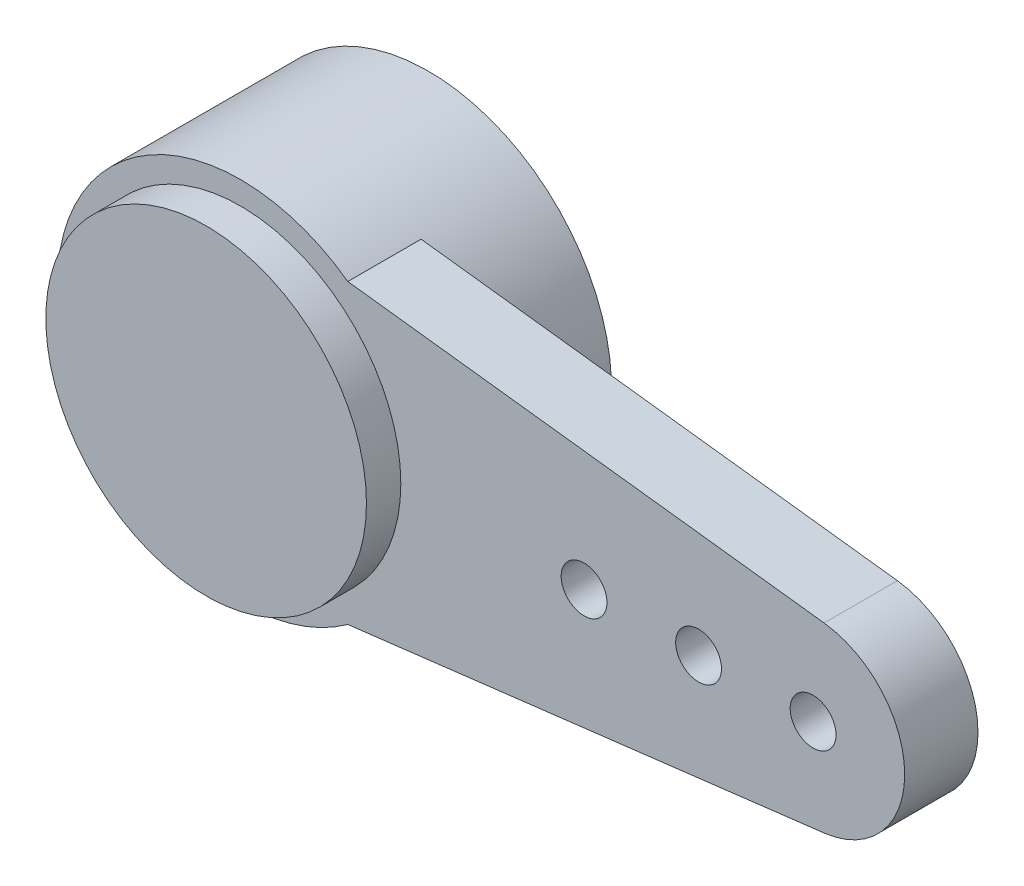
from build123d import *

# Parameters (mm, degrees)
ESQUISSE1_R                  = 0.5
EXTRUSION6_DEPTH             = 1.6
ESQUISSE2_R                  = 3.5
EXTRUSION7_DEPTH             = 0.75
ESQUISSE3_R                  = 4
EXTRUSION8_DEPTH             = 2.5
EXTRUSION8_DIRECTION_2_REACH = 17.1
ESQUISSE4_R                  = 2.9
EXTRUSION9_DEPTH             = 2.7


with BuildPart() as part:
    # Esquisse1 → Extrusion6 (new body)
    with BuildSketch(Plane.XY):
        with BuildLine():
            Line((0.42, 3.474708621), (12.74, 1.985547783))
            ThreePointArc((12.74, 1.985547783), (14.5, 0), (12.74, -1.985547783))
            Line((12.74, -1.985547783), (0.42, -3.474708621))
            ThreePointArc((0.42, -3.474708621), (-3.5, 0), (0.42, 3.474708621))
        make_face()
        with Locations((7.5, 0)):
            Circle(ESQUISSE1_R, mode=Mode.SUBTRACT)
        with Locations((10, 0)):
            Circle(ESQUISSE1_R, mode=Mode.SUBTRACT)
        with Locations((12.5, 0)):
            Circle(ESQUISSE1_R, mode=Mode.SUBTRACT)
    extrude(amount=EXTRUSION6_DEPTH)

    # Esquisse2 → Extrusion7 (add)
    with BuildSketch(Plane.XY.offset(1.6)):
        with Locations(Location((0, 0, 0), (0, 0, 276.892102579))):
            Circle(ESQUISSE2_R)
    extrude(amount=EXTRUSION7_DEPTH)

    # Esquisse3 → Extrusion8 (add)
    with BuildSketch(Plane(origin=(0, 0, 0), x_dir=(-1, 0, 0), z_dir=(0, 0, -1))):
        Circle(ESQUISSE3_R)
    extrude(amount=EXTRUSION8_DEPTH)

    # Extrusion8 direction 2: up to this face of the body (flat: up to its plane)
    extrusion8_direction_2_end = Plane(part.part.faces().sort_by_distance((3.657016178, 0, 1.6))[0])
    # Esquisse3 → Extrusion8 direction 2 (add, up to the picked face)
    with BuildSketch(Plane(origin=(0, 0, 0), x_dir=(-1, 0, 0), z_dir=(0, 0, -1)), mode=Mode.PRIVATE) as extrusion8_direction_2_sk1:
        Circle(ESQUISSE3_R)
    extrusion8_direction_2_tool1 = split(extrude(extrusion8_direction_2_sk1.sketch, amount=-EXTRUSION8_DIRECTION_2_REACH, mode=Mode.PRIVATE), bisect_by=extrusion8_direction_2_end, keep=Keep.BOTH, mode=Mode.PRIVATE)
    add(extrusion8_direction_2_tool1.solids().sort_by(Axis((0, 0, 0), (0, 0, 1)))[0])

    # Esquisse4 → Extrusion9 (cut)
    with BuildSketch(Plane(origin=(0, 0, -2.5), x_dir=(-1, 0, 0), z_dir=(0, 0, -1))):
        Circle(ESQUISSE4_R)
    extrude(amount=-EXTRUSION9_DEPTH, mode=Mode.SUBTRACT)


solid = part.part
